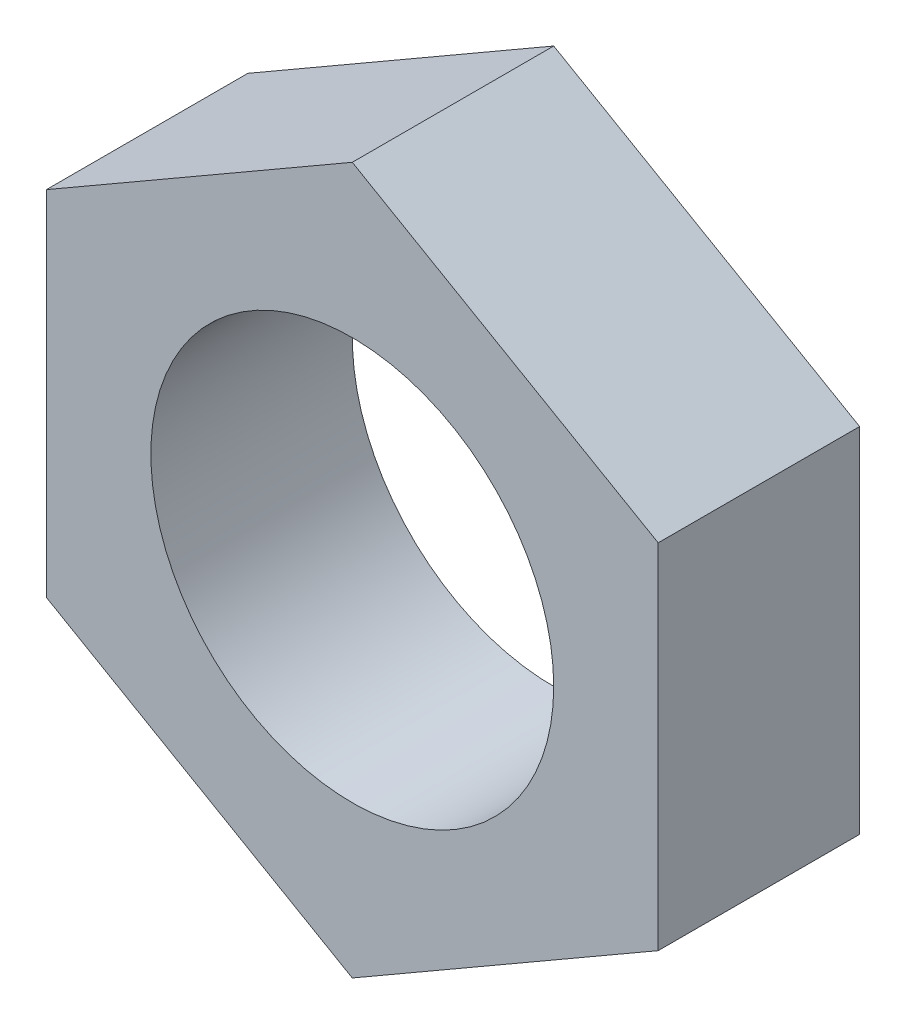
ISO-10303-21;
HEADER;
FILE_DESCRIPTION(('STEP AP214'),'2;1');
FILE_NAME('part.step','',(''),(''),'','','');
FILE_SCHEMA(('AUTOMOTIVE_DESIGN { 1 0 10303 214 1 1 1 1 }'));
ENDSEC;
DATA;
#1=APPLICATION_CONTEXT('core data for automotive mechanical design processes');
#2=APPLICATION_PROTOCOL_DEFINITION('international standard','automotive_design',2000,#1);
#3=PRODUCT_CONTEXT('',#1,'mechanical');
#4=PRODUCT('Part','Part','',(#3));
#5=PRODUCT_RELATED_PRODUCT_CATEGORY('part','',(#4));
#6=PRODUCT_DEFINITION_FORMATION('','',#4);
#7=PRODUCT_DEFINITION_CONTEXT('part definition',#1,'design');
#8=PRODUCT_DEFINITION('design','',#6,#7);
#9=PRODUCT_DEFINITION_SHAPE('','',#8);
#10=(LENGTH_UNIT() NAMED_UNIT(*) SI_UNIT(.MILLI.,.METRE.));
#11=(NAMED_UNIT(*) PLANE_ANGLE_UNIT() SI_UNIT($,.RADIAN.));
#12=(NAMED_UNIT(*) SI_UNIT($,.STERADIAN.) SOLID_ANGLE_UNIT());
#13=UNCERTAINTY_MEASURE_WITH_UNIT(LENGTH_MEASURE(1.E-05),#10,'distance_accuracy_value','');
#14=(GEOMETRIC_REPRESENTATION_CONTEXT(3) GLOBAL_UNCERTAINTY_ASSIGNED_CONTEXT((#13)) GLOBAL_UNIT_ASSIGNED_CONTEXT((#10,
#11,#12)) REPRESENTATION_CONTEXT('',''));
#15=CARTESIAN_POINT('',(0.,0.,0.));
#16=DIRECTION('',(0.,0.,1.));
#17=DIRECTION('',(1.,0.,0.));
#18=AXIS2_PLACEMENT_3D('',#15,#16,#17);
#19=CARTESIAN_POINT('',(-20.5,-11.8356805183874,13.5));
#20=DIRECTION('',(0.,0.,-1.));
#21=DIRECTION('',(-1.,0.,0.));
#22=AXIS2_PLACEMENT_3D('',#19,#20,#21);
#23=PLANE('',#22);
#24=DIRECTION('',(0.866025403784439,-0.5,0.));
#25=VECTOR('',#24,1.);
#26=CARTESIAN_POINT('',(-20.5,-11.8356805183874,13.5));
#27=LINE('',#26,#25);
#28=CARTESIAN_POINT('',(-20.5,-11.8356805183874,13.5));
#29=VERTEX_POINT('',#28);
#30=CARTESIAN_POINT('',(0.,-23.6713610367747,13.5));
#31=VERTEX_POINT('',#30);
#32=EDGE_CURVE('E120',#29,#31,#27,.T.);
#33=ORIENTED_EDGE('',*,*,#32,.T.);
#34=DIRECTION('',(0.866025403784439,0.5,0.));
#35=VECTOR('',#34,1.);
#36=CARTESIAN_POINT('',(0.,-23.6713610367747,13.5));
#37=LINE('',#36,#35);
#38=CARTESIAN_POINT('',(20.5,-11.8356805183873,13.5));
#39=VERTEX_POINT('',#38);
#40=EDGE_CURVE('E78',#31,#39,#37,.T.);
#41=ORIENTED_EDGE('',*,*,#40,.T.);
#42=DIRECTION('',(0.,1.,0.));
#43=VECTOR('',#42,1.);
#44=CARTESIAN_POINT('',(20.5,-11.8356805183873,13.5));
#45=LINE('',#44,#43);
#46=CARTESIAN_POINT('',(20.5,11.8356805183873,13.5));
#47=VERTEX_POINT('',#46);
#48=EDGE_CURVE('E91',#39,#47,#45,.T.);
#49=ORIENTED_EDGE('',*,*,#48,.T.);
#50=DIRECTION('',(-0.866025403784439,0.5,0.));
#51=VECTOR('',#50,1.);
#52=CARTESIAN_POINT('',(20.5,11.8356805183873,13.5));
#53=LINE('',#52,#51);
#54=CARTESIAN_POINT('',(0.,23.6713610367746,13.5));
#55=VERTEX_POINT('',#54);
#56=EDGE_CURVE('E85',#47,#55,#53,.T.);
#57=ORIENTED_EDGE('',*,*,#56,.T.);
#58=DIRECTION('',(-0.866025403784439,-0.5,0.));
#59=VECTOR('',#58,1.);
#60=CARTESIAN_POINT('',(0.,23.6713610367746,13.5));
#61=LINE('',#60,#59);
#62=CARTESIAN_POINT('',(-20.5,11.8356805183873,13.5));
#63=VERTEX_POINT('',#62);
#64=EDGE_CURVE('E89',#55,#63,#61,.T.);
#65=ORIENTED_EDGE('',*,*,#64,.T.);
#66=DIRECTION('',(0.,-1.,0.));
#67=VECTOR('',#66,1.);
#68=CARTESIAN_POINT('',(-20.5,11.8356805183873,13.5));
#69=LINE('',#68,#67);
#70=EDGE_CURVE('E41',#63,#29,#69,.T.);
#71=ORIENTED_EDGE('',*,*,#70,.T.);
#72=EDGE_LOOP('',(#33,#41,#49,#57,#65,#71));
#73=FACE_BOUND('',#72,.T.);
#74=CARTESIAN_POINT('',(0.,0.,13.5));
#75=DIRECTION('',(0.,0.,1.));
#76=DIRECTION('',(1.,0.,0.));
#77=AXIS2_PLACEMENT_3D('',#74,#75,#76);
#78=CIRCLE('',#77,13.5);
#79=CARTESIAN_POINT('',(13.5,0.,13.5));
#80=VERTEX_POINT('',#79);
#81=EDGE_CURVE('E113',#80,#80,#78,.T.);
#82=ORIENTED_EDGE('',*,*,#81,.F.);
#83=EDGE_LOOP('',(#82));
#84=FACE_BOUND('',#83,.T.);
#85=ADVANCED_FACE('F24',(#73,#84),#23,.F.);
#86=CARTESIAN_POINT('',(-20.5,-11.8356805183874,0.));
#87=DIRECTION('',(0.,0.,-1.));
#88=DIRECTION('',(-1.,0.,0.));
#89=AXIS2_PLACEMENT_3D('',#86,#87,#88);
#90=PLANE('',#89);
#91=DIRECTION('',(0.866025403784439,-0.5,0.));
#92=VECTOR('',#91,1.);
#93=CARTESIAN_POINT('',(-20.5,-11.8356805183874,0.));
#94=LINE('',#93,#92);
#95=CARTESIAN_POINT('',(-20.5,-11.8356805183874,0.));
#96=VERTEX_POINT('',#95);
#97=CARTESIAN_POINT('',(0.,-23.6713610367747,0.));
#98=VERTEX_POINT('',#97);
#99=EDGE_CURVE('E109',#96,#98,#94,.T.);
#100=ORIENTED_EDGE('',*,*,#99,.F.);
#101=DIRECTION('',(0.,-1.,0.));
#102=VECTOR('',#101,1.);
#103=CARTESIAN_POINT('',(-20.5,11.8356805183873,0.));
#104=LINE('',#103,#102);
#105=CARTESIAN_POINT('',(-20.5,11.8356805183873,0.));
#106=VERTEX_POINT('',#105);
#107=EDGE_CURVE('E70',#106,#96,#104,.T.);
#108=ORIENTED_EDGE('',*,*,#107,.F.);
#109=DIRECTION('',(-0.866025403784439,-0.5,0.));
#110=VECTOR('',#109,1.);
#111=CARTESIAN_POINT('',(0.,23.6713610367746,0.));
#112=LINE('',#111,#110);
#113=CARTESIAN_POINT('',(0.,23.6713610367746,0.));
#114=VERTEX_POINT('',#113);
#115=EDGE_CURVE('E64',#114,#106,#112,.T.);
#116=ORIENTED_EDGE('',*,*,#115,.F.);
#117=DIRECTION('',(-0.866025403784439,0.5,0.));
#118=VECTOR('',#117,1.);
#119=CARTESIAN_POINT('',(20.5,11.8356805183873,0.));
#120=LINE('',#119,#118);
#121=CARTESIAN_POINT('',(20.5,11.8356805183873,0.));
#122=VERTEX_POINT('',#121);
#123=EDGE_CURVE('E99',#122,#114,#120,.T.);
#124=ORIENTED_EDGE('',*,*,#123,.F.);
#125=DIRECTION('',(0.,1.,0.));
#126=VECTOR('',#125,1.);
#127=CARTESIAN_POINT('',(20.5,-11.8356805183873,0.));
#128=LINE('',#127,#126);
#129=CARTESIAN_POINT('',(20.5,-11.8356805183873,0.));
#130=VERTEX_POINT('',#129);
#131=EDGE_CURVE('E115',#130,#122,#128,.T.);
#132=ORIENTED_EDGE('',*,*,#131,.F.);
#133=DIRECTION('',(0.866025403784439,0.5,0.));
#134=VECTOR('',#133,1.);
#135=CARTESIAN_POINT('',(0.,-23.6713610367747,0.));
#136=LINE('',#135,#134);
#137=EDGE_CURVE('E112',#98,#130,#136,.T.);
#138=ORIENTED_EDGE('',*,*,#137,.F.);
#139=EDGE_LOOP('',(#100,#108,#116,#124,#132,#138));
#140=FACE_BOUND('',#139,.T.);
#141=CARTESIAN_POINT('',(0.,0.,0.));
#142=DIRECTION('',(0.,0.,1.));
#143=DIRECTION('',(1.,0.,0.));
#144=AXIS2_PLACEMENT_3D('',#141,#142,#143);
#145=CIRCLE('',#144,13.5);
#146=CARTESIAN_POINT('',(13.5,0.,0.));
#147=VERTEX_POINT('',#146);
#148=EDGE_CURVE('E180',#147,#147,#145,.T.);
#149=ORIENTED_EDGE('',*,*,#148,.T.);
#150=EDGE_LOOP('',(#149));
#151=FACE_BOUND('',#150,.T.);
#152=ADVANCED_FACE('F129',(#140,#151),#90,.T.);
#153=CARTESIAN_POINT('',(-20.5,-11.8356805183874,13.5));
#154=DIRECTION('',(0.5,0.866025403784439,0.));
#155=DIRECTION('',(-0.866025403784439,0.5,0.));
#156=AXIS2_PLACEMENT_3D('',#153,#154,#155);
#157=PLANE('',#156);
#158=ORIENTED_EDGE('',*,*,#99,.T.);
#159=DIRECTION('',(0.,0.,-1.));
#160=VECTOR('',#159,1.);
#161=CARTESIAN_POINT('',(0.,-23.6713610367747,13.5));
#162=LINE('',#161,#160);
#163=EDGE_CURVE('E13',#31,#98,#162,.T.);
#164=ORIENTED_EDGE('',*,*,#163,.F.);
#165=ORIENTED_EDGE('',*,*,#32,.F.);
#166=DIRECTION('',(0.,0.,-1.));
#167=VECTOR('',#166,1.);
#168=CARTESIAN_POINT('',(-20.5,-11.8356805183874,13.5));
#169=LINE('',#168,#167);
#170=EDGE_CURVE('E105',#29,#96,#169,.T.);
#171=ORIENTED_EDGE('',*,*,#170,.T.);
#172=EDGE_LOOP('',(#158,#164,#165,#171));
#173=FACE_BOUND('',#172,.T.);
#174=ADVANCED_FACE('F26',(#173),#157,.F.);
#175=CARTESIAN_POINT('',(0.,-23.6713610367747,13.5));
#176=DIRECTION('',(-0.5,0.866025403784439,0.));
#177=DIRECTION('',(-0.866025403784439,-0.5,0.));
#178=AXIS2_PLACEMENT_3D('',#175,#176,#177);
#179=PLANE('',#178);
#180=ORIENTED_EDGE('',*,*,#137,.T.);
#181=DIRECTION('',(0.,0.,-1.));
#182=VECTOR('',#181,1.);
#183=CARTESIAN_POINT('',(20.5,-11.8356805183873,13.5));
#184=LINE('',#183,#182);
#185=EDGE_CURVE('E33',#39,#130,#184,.T.);
#186=ORIENTED_EDGE('',*,*,#185,.F.);
#187=ORIENTED_EDGE('',*,*,#40,.F.);
#188=ORIENTED_EDGE('',*,*,#163,.T.);
#189=EDGE_LOOP('',(#180,#186,#187,#188));
#190=FACE_BOUND('',#189,.T.);
#191=ADVANCED_FACE('F155',(#190),#179,.F.);
#192=CARTESIAN_POINT('',(20.5,-11.8356805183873,13.5));
#193=DIRECTION('',(-1.,0.,0.));
#194=DIRECTION('',(0.,-1.,0.));
#195=AXIS2_PLACEMENT_3D('',#192,#193,#194);
#196=PLANE('',#195);
#197=ORIENTED_EDGE('',*,*,#131,.T.);
#198=DIRECTION('',(0.,0.,-1.));
#199=VECTOR('',#198,1.);
#200=CARTESIAN_POINT('',(20.5,11.8356805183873,13.5));
#201=LINE('',#200,#199);
#202=EDGE_CURVE('E100',#47,#122,#201,.T.);
#203=ORIENTED_EDGE('',*,*,#202,.F.);
#204=ORIENTED_EDGE('',*,*,#48,.F.);
#205=ORIENTED_EDGE('',*,*,#185,.T.);
#206=EDGE_LOOP('',(#197,#203,#204,#205));
#207=FACE_BOUND('',#206,.T.);
#208=ADVANCED_FACE('F126',(#207),#196,.F.);
#209=CARTESIAN_POINT('',(20.5,11.8356805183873,13.5));
#210=DIRECTION('',(-0.5,-0.866025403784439,0.));
#211=DIRECTION('',(0.866025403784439,-0.5,0.));
#212=AXIS2_PLACEMENT_3D('',#209,#210,#211);
#213=PLANE('',#212);
#214=ORIENTED_EDGE('',*,*,#123,.T.);
#215=DIRECTION('',(0.,0.,-1.));
#216=VECTOR('',#215,1.);
#217=CARTESIAN_POINT('',(0.,23.6713610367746,13.5));
#218=LINE('',#217,#216);
#219=EDGE_CURVE('E96',#55,#114,#218,.T.);
#220=ORIENTED_EDGE('',*,*,#219,.F.);
#221=ORIENTED_EDGE('',*,*,#56,.F.);
#222=ORIENTED_EDGE('',*,*,#202,.T.);
#223=EDGE_LOOP('',(#214,#220,#221,#222));
#224=FACE_BOUND('',#223,.T.);
#225=ADVANCED_FACE('F97',(#224),#213,.F.);
#226=CARTESIAN_POINT('',(0.,23.6713610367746,13.5));
#227=DIRECTION('',(0.5,-0.866025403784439,0.));
#228=DIRECTION('',(0.866025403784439,0.5,0.));
#229=AXIS2_PLACEMENT_3D('',#226,#227,#228);
#230=PLANE('',#229);
#231=ORIENTED_EDGE('',*,*,#115,.T.);
#232=DIRECTION('',(0.,0.,-1.));
#233=VECTOR('',#232,1.);
#234=CARTESIAN_POINT('',(-20.5,11.8356805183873,13.5));
#235=LINE('',#234,#233);
#236=EDGE_CURVE('E101',#63,#106,#235,.T.);
#237=ORIENTED_EDGE('',*,*,#236,.F.);
#238=ORIENTED_EDGE('',*,*,#64,.F.);
#239=ORIENTED_EDGE('',*,*,#219,.T.);
#240=EDGE_LOOP('',(#231,#237,#238,#239));
#241=FACE_BOUND('',#240,.T.);
#242=ADVANCED_FACE('F103',(#241),#230,.F.);
#243=CARTESIAN_POINT('',(-20.5,11.8356805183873,13.5));
#244=DIRECTION('',(1.,0.,0.));
#245=DIRECTION('',(0.,0.,-1.));
#246=AXIS2_PLACEMENT_3D('',#243,#244,#245);
#247=PLANE('',#246);
#248=ORIENTED_EDGE('',*,*,#107,.T.);
#249=ORIENTED_EDGE('',*,*,#170,.F.);
#250=ORIENTED_EDGE('',*,*,#70,.F.);
#251=ORIENTED_EDGE('',*,*,#236,.T.);
#252=EDGE_LOOP('',(#248,#249,#250,#251));
#253=FACE_BOUND('',#252,.T.);
#254=ADVANCED_FACE('F134',(#253),#247,.F.);
#255=CARTESIAN_POINT('',(0.,0.,13.5));
#256=DIRECTION('',(0.,0.,-1.));
#257=DIRECTION('',(-1.,0.,0.));
#258=AXIS2_PLACEMENT_3D('',#255,#256,#257);
#259=CYLINDRICAL_SURFACE('',#258,13.5);
#260=ORIENTED_EDGE('',*,*,#81,.T.);
#261=EDGE_LOOP('',(#260));
#262=FACE_BOUND('',#261,.T.);
#263=ORIENTED_EDGE('',*,*,#148,.F.);
#264=EDGE_LOOP('',(#263));
#265=FACE_BOUND('',#264,.T.);
#266=ADVANCED_FACE('F136',(#262,#265),#259,.F.);
#267=CLOSED_SHELL('',(#85,#152,#174,#191,#208,#225,#242,#254,#266));
#268=MANIFOLD_SOLID_BREP('B1',#267);
#269=ADVANCED_BREP_SHAPE_REPRESENTATION('',(#18,#268),#14);
#270=SHAPE_DEFINITION_REPRESENTATION(#9,#269);
ENDSEC;
END-ISO-10303-21;
